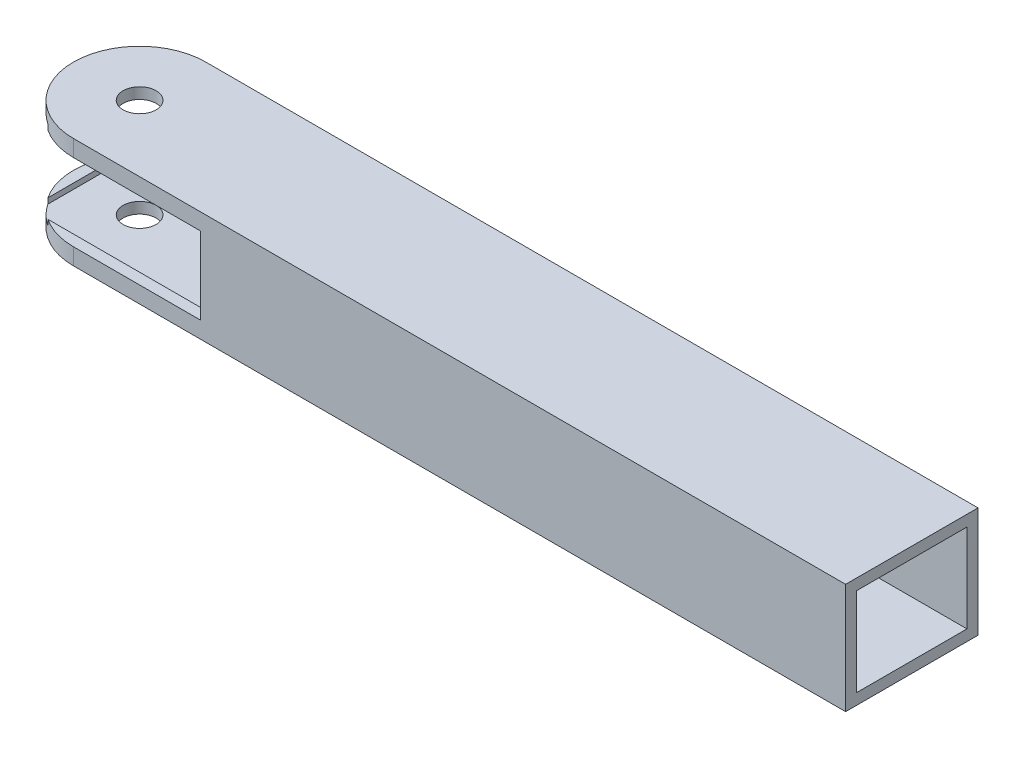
from build123d import *

# Parameters (mm, degrees)
SZKIC1_R                    = 1.5
DODANIE_WYCI_GNI_CIE1_DEPTH = 10
SZKIC2_W                    = 35
SZKIC2_H                    = 7
WYTNIJ_WYCI_GNI_CIE1_DEPTH  = 72.721684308
SZKIC3_W                    = 10
SZKIC3_H                    = 8
WYTNIJ_WYCI_GNI_CIE2_DEPTH  = 75


with BuildPart() as part:
    # Szkic1 → Dodanie-wyci_gni_cie1 (new body)
    with BuildSketch(Plane(origin=(0, 0, 0), x_dir=(1, 0, 0), z_dir=(0, 1, 0))):
        with BuildLine():
            Line((0, 6), (70, 6))
            Line((70, 6), (70, -6))
            Line((70, -6), (0, -6))
            ThreePointArc((0, -6), (-6, 0), (0, 6))
        make_face()
        with Locations(Location((0, 0, 0), (0, 0, 270))):
            Circle(SZKIC1_R, mode=Mode.SUBTRACT)
    extrude(amount=DODANIE_WYCI_GNI_CIE1_DEPTH)

    # Szkic2 → Wytnij-wyci_gni_cie1 (cut, through all)
    with BuildSketch(Plane(origin=(0, 0, -6), x_dir=(-1, 0, 0), z_dir=(0, 0, -1))):
        with Locations((6, 5)):
            Rectangle(SZKIC2_W, SZKIC2_H)
    extrude(amount=-WYTNIJ_WYCI_GNI_CIE1_DEPTH, mode=Mode.SUBTRACT)

    # Szkic3 → Wytnij-wyci_gni_cie2 (cut)
    with BuildSketch(Plane(origin=(70, 0, 0), x_dir=(0, 0, -1), z_dir=(1, 0, 0))):
        with Locations((0, 5)):
            Rectangle(SZKIC3_W, SZKIC3_H)
    extrude(amount=-WYTNIJ_WYCI_GNI_CIE2_DEPTH, mode=Mode.SUBTRACT)


solid = part.part
